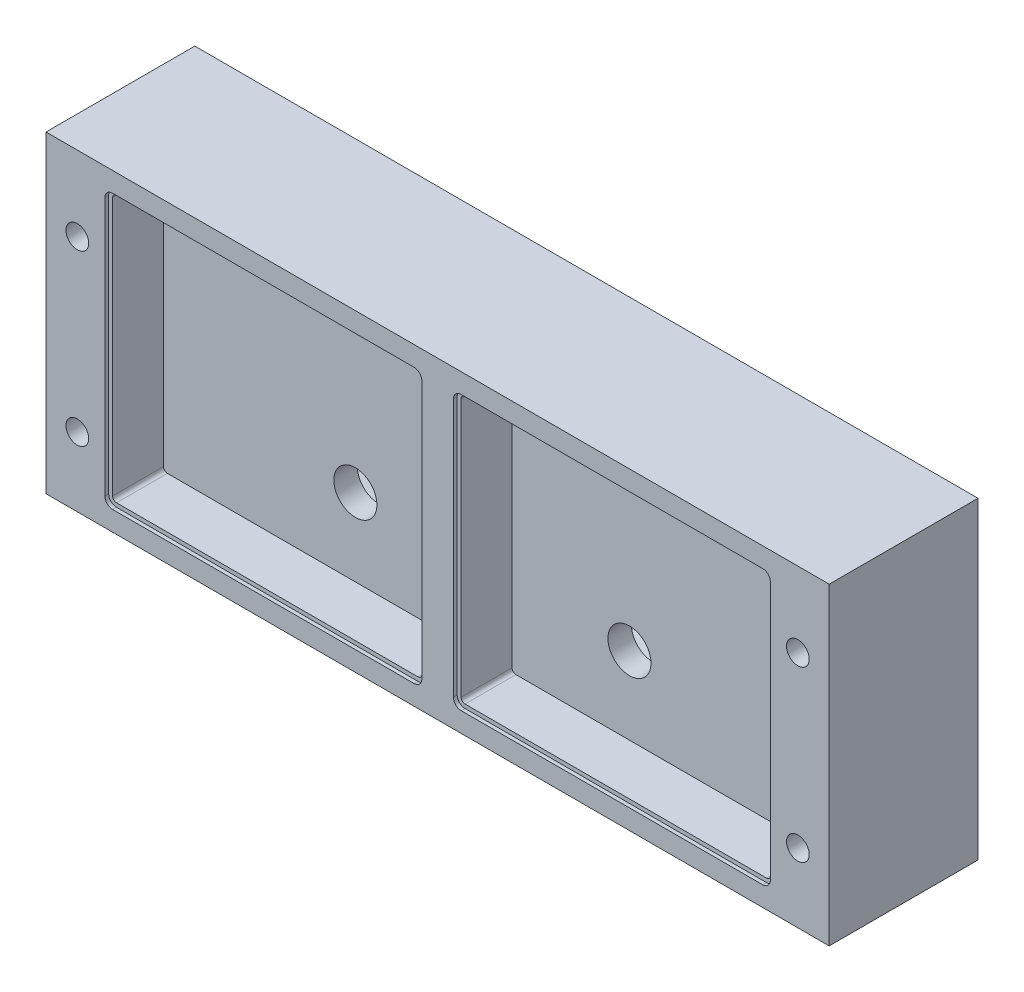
from build123d import *

# Parameters (mm, degrees)
SKETCH1_W           = 100
SKETCH1_H           = 40
BOSS_EXTRUDE1_DEPTH = 38
CUT_EXTRUDE2_START  = -12
SKETCH2_W           = 39.5
SKETCH2_H           = 34
CUT_EXTRUDE2_DEPTH  = 21
CUT_EXTRUDE4_REACH  = 81.36
SKETCH4_R           = 1.45
SKETCH6_W           = 100
SKETCH6_H           = 19
CUT_EXTRUDE5_DEPTH  = 87.215210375
FILLET1_R           = 0.5
CUT_EXTRUDE6_START  = 6.5
CUT_EXTRUDE6_DEPTH  = 0.5
CUT_EXTRUDE6_TAPER  = 2
CUT_EXTRUDE7_START  = 6.5
CUT_EXTRUDE7_DEPTH  = 0.5
CUT_EXTRUDE7_TAPER  = 2
CUT_EXTRUDE8_DEPTH  = 9
CUT_EXTRUDE9_REACH  = 72.385
SKETCH14_R          = 2.75
BOSS_EXTRUDE2_START = 8
BOSS_EXTRUDE2_DEPTH = 1
BOSS_EXTRUDE2_DRAFT = 2
CUT_EXTRUDE11_START = 9
CUT_EXTRUDE11_DEPTH = 1


with BuildPart() as part:
    # Sketch1 → Boss-Extrude1 (new body)
    with BuildSketch(Plane.XY):
        with Locations((16.25, 1.5625)):
            Rectangle(SKETCH1_W, SKETCH1_H)
    extrude(amount=BOSS_EXTRUDE1_DEPTH)

    # Sketch2 → Cut-Extrude2 (cut)
    with BuildSketch(Plane(origin=(0, 0, 0), x_dir=(-1, 0, 0), z_dir=(0, 0, -1)).offset(CUT_EXTRUDE2_START)):
        with Locations((-38.5, 1.5625)):
            Rectangle(SKETCH2_W, SKETCH2_H)
        with Locations((6, 1.5625)):
            Rectangle(SKETCH2_W, SKETCH2_H)
    extrude(amount=-CUT_EXTRUDE2_DEPTH, mode=Mode.SUBTRACT)

    # Sketch4 → Cut-Extrude4 (cut, up to next)
    with BuildSketch(Plane(origin=(0, 0, 0), x_dir=(-1, 0, 0), z_dir=(0, 0, -1)), mode=Mode.PRIVATE) as cut_extrude4_sk1:
        with Locations((-62.25, 11.98479819)):
            Circle(SKETCH4_R)
    cut_extrude4_tool1 = extrude(cut_extrude4_sk1.sketch, amount=-CUT_EXTRUDE4_REACH, mode=Mode.PRIVATE) & part.part
    # Sketch4 → Cut-Extrude4 (cut, up to next)
    with BuildSketch(Plane(origin=(0, 0, 0), x_dir=(-1, 0, 0), z_dir=(0, 0, -1)), mode=Mode.PRIVATE) as cut_extrude4_sk2:
        with Locations((-62.25, -9.616561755)):
            Circle(SKETCH4_R)
    cut_extrude4_tool2 = extrude(cut_extrude4_sk2.sketch, amount=-CUT_EXTRUDE4_REACH, mode=Mode.PRIVATE) & part.part
    # Sketch4 → Cut-Extrude4 (cut, up to next)
    with BuildSketch(Plane(origin=(0, 0, 0), x_dir=(-1, 0, 0), z_dir=(0, 0, -1)), mode=Mode.PRIVATE) as cut_extrude4_sk3:
        with Locations((29.75, 11.98479819)):
            Circle(SKETCH4_R)
    cut_extrude4_tool3 = extrude(cut_extrude4_sk3.sketch, amount=-CUT_EXTRUDE4_REACH, mode=Mode.PRIVATE) & part.part
    # Sketch4 → Cut-Extrude4 (cut, up to next)
    with BuildSketch(Plane(origin=(0, 0, 0), x_dir=(-1, 0, 0), z_dir=(0, 0, -1)), mode=Mode.PRIVATE) as cut_extrude4_sk4:
        with Locations((29.75, -9.616561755)):
            Circle(SKETCH4_R)
    cut_extrude4_tool4 = extrude(cut_extrude4_sk4.sketch, amount=-CUT_EXTRUDE4_REACH, mode=Mode.PRIVATE) & part.part
    add(cut_extrude4_tool1.solids().sort_by_distance((62.25, 11.984798, 0))[0], mode=Mode.SUBTRACT)
    add(cut_extrude4_tool2.solids().sort_by_distance((62.25, -9.616562, 0))[0], mode=Mode.SUBTRACT)
    add(cut_extrude4_tool3.solids().sort_by_distance((-29.75, 11.984798, 0))[0], mode=Mode.SUBTRACT)
    add(cut_extrude4_tool4.solids().sort_by_distance((-29.75, -9.616562, 0))[0], mode=Mode.SUBTRACT)

    # Sketch6 → Cut-Extrude5 (cut, through all)
    with BuildSketch(Plane(origin=(0, 21.5625, 0), x_dir=(1, 0, 0), z_dir=(0, 1, 0))):
        with Locations((16.25, -28.5)):
            Rectangle(SKETCH6_W, SKETCH6_H)
    extrude(amount=-CUT_EXTRUDE5_DEPTH, mode=Mode.SUBTRACT)

    # Fillet1
    fillet1_edges = [part.edges().sort_by_distance(p)[0] for p in [
        (-25.75, -15.4375, 15.5),
        (13.75, -15.4375, 15.5),
        (-25.75, 18.5625, 15.5),
        (13.75, 18.5625, 15.5),
        (18.75, -15.4375, 15.5),
        (58.25, -15.4375, 15.5),
        (18.75, 18.5625, 15.5),
        (58.25, 18.5625, 15.5),
    ]]
    fillet(fillet1_edges, radius=FILLET1_R)

    # Sketch10 → Cut-Extrude6 (cut)
    with BuildSketch(Plane.XY.offset(12).offset(CUT_EXTRUDE6_START)):
        with BuildLine():
            Line((14.25, -14.9375), (14.25, 18.0625))
            ThreePointArc((14.25, 18.0625), (13.957106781, 18.769606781), (13.25, 19.0625))
            Line((13.25, 19.0625), (-25.25, 19.0625))
            ThreePointArc((-25.25, 19.0625), (-25.957106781, 18.769606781), (-26.25, 18.0625))
            Line((-26.25, 18.0625), (-26.25, -14.9375))
            ThreePointArc((-26.25, -14.9375), (-25.957106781, -15.644606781), (-25.25, -15.9375))
            Line((-25.25, -15.9375), (13.25, -15.9375))
            ThreePointArc((13.25, -15.9375), (13.957106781, -15.644606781), (14.25, -14.9375))
        make_face()
    extrude(amount=CUT_EXTRUDE6_DEPTH, taper=CUT_EXTRUDE6_TAPER, mode=Mode.SUBTRACT)

    # Sketch11 → Cut-Extrude7 (cut)
    with BuildSketch(Plane.XY.offset(12).offset(CUT_EXTRUDE7_START)):
        with BuildLine():
            Line((58.75, -14.9375), (58.75, 18.0625))
            ThreePointArc((58.75, 18.0625), (58.457106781, 18.769606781), (57.75, 19.0625))
            Line((57.75, 19.0625), (19.25, 19.0625))
            ThreePointArc((19.25, 19.0625), (18.542893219, 18.769606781), (18.25, 18.0625))
            Line((18.25, 18.0625), (18.25, -14.9375))
            ThreePointArc((18.25, -14.9375), (18.542893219, -15.644606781), (19.25, -15.9375))
            Line((19.25, -15.9375), (57.75, -15.9375))
            ThreePointArc((57.75, -15.9375), (58.457106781, -15.644606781), (58.75, -14.9375))
        make_face()
    extrude(amount=CUT_EXTRUDE7_DEPTH, taper=CUT_EXTRUDE7_TAPER, mode=Mode.SUBTRACT)

    # Sketch12 → Cut-Extrude8 (cut)
    with BuildSketch(Plane(origin=(0, 0, 0), x_dir=(-1, 0, 0), z_dir=(0, 0, -1))):
        with BuildLine():
            ThreePointArc((-57.865926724, 2.836052), (-16.25, -14.444957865), (25.365926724, 2.836052))
            ThreePointArc((25.365926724, 2.836052), (25.351045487, 11.250609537), (16.93648795, 11.235728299))
            ThreePointArc((16.93648795, 11.235728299), (-16.25, -2.544957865), (-49.43648795, 11.235728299))
            ThreePointArc((-49.43648795, 11.235728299), (-57.851045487, 11.250609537), (-57.865926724, 2.836052))
        make_face()
    extrude(amount=-CUT_EXTRUDE8_DEPTH, mode=Mode.SUBTRACT)

    # Sketch14 → Cut-Extrude9 (cut, up to next)
    with BuildSketch(Plane(origin=(0, 0, 9), x_dir=(-1, 0, 0), z_dir=(0, 0, -1)), mode=Mode.PRIVATE) as cut_extrude9_sk1:
        with Locations((-33.75, -5.553059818)):
            Circle(SKETCH14_R)
    cut_extrude9_tool1 = extrude(cut_extrude9_sk1.sketch, amount=-CUT_EXTRUDE9_REACH, mode=Mode.PRIVATE) & part.part
    # Sketch14 → Cut-Extrude9 (cut, up to next)
    with BuildSketch(Plane(origin=(0, 0, 9), x_dir=(-1, 0, 0), z_dir=(0, 0, -1)), mode=Mode.PRIVATE) as cut_extrude9_sk2:
        with Locations((1.25, -5.553059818)):
            Circle(SKETCH14_R)
    cut_extrude9_tool2 = extrude(cut_extrude9_sk2.sketch, amount=-CUT_EXTRUDE9_REACH, mode=Mode.PRIVATE) & part.part
    add(cut_extrude9_tool1.solids().sort_by_distance((33.75, -5.55306, 9))[0], mode=Mode.SUBTRACT)
    add(cut_extrude9_tool2.solids().sort_by_distance((-1.25, -5.55306, 9))[0], mode=Mode.SUBTRACT)


with BuildPart() as body_2:
    # Sketch15 → Boss-Extrude2 (with draft: the straight prism first)
    with BuildSketch(Plane(origin=(0, 0, 9), x_dir=(-1, 0, 0), z_dir=(0, 0, -1)).offset(BOSS_EXTRUDE2_START)):
        with BuildLine():
            ThreePointArc((-49.43648795, 11.235728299), (-57.851045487, 11.250609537), (-57.865926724, 2.836052))
            ThreePointArc((-57.865926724, 2.836052), (-16.25, -14.444957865), (25.365926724, 2.836052))
            ThreePointArc((25.365926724, 2.836052), (25.351045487, 11.250609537), (16.93648795, 11.235728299))
            ThreePointArc((16.93648795, 11.235728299), (-16.25, -2.544957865), (-49.43648795, 11.235728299))
        make_face()
        with BuildLine():
            ThreePointArc((-50.144844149, 10.529873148), (-57.145190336, 10.542253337), (-57.157570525, 3.541907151))
            ThreePointArc((-57.157570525, 3.541907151), (-16.25, -13.444957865), (24.657570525, 3.541907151))
            ThreePointArc((24.657570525, 3.541907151), (24.645190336, 10.542253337), (17.644844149, 10.529873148))
            ThreePointArc((17.644844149, 10.529873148), (-16.25, -3.544957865), (-50.144844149, 10.529873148))
        make_face(mode=Mode.SUBTRACT)
    extrude(amount=BOSS_EXTRUDE2_DEPTH)
    # Boss-Extrude2: the draft: its side faces are tilted about the plane it starts from
    boss_extrude2_sides = [body_2.faces().sort_by_distance(p)[0] for p in [
        (-25.351045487, 11.250609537, 0.5),
        (16.25, -2.544957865, 0.5),
        (57.851045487, 11.250609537, 0.5),
        (16.25, -14.444957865, 0.5),
        (16.25, -13.444957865, 0.5),
        (57.145190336, 10.542253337, 0.5),
        (16.25, -3.544957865, 0.5),
        (-24.645190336, 10.542253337, 0.5),
    ]]
    draft(boss_extrude2_sides, Plane(origin=(0, 0, 9), x_dir=(-1, 0, 0), z_dir=(0, 0, -1)).offset(BOSS_EXTRUDE2_START), BOSS_EXTRUDE2_DRAFT)

    # Sketch16 → Cut-Extrude11 (cut)
    with BuildSketch(Plane(origin=(0, 0, 9), x_dir=(-1, 0, 0), z_dir=(0, 0, -1)).offset(CUT_EXTRUDE11_START)):
        with BuildLine():
            Line((-29.154329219, -0.73272854), (-29.429768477, -1.694047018))
            ThreePointArc((-29.429768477, -1.694047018), (-16.25, -3.544957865), (-3.070231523, -1.694047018))
            Line((-3.070231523, -1.694047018), (-3.345670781, -0.73272854))
            ThreePointArc((-3.345670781, -0.73272854), (-16.25, -2.544957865), (-29.154329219, -0.73272854))
        make_face()
        with BuildLine():
            Line((1.427332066, -10.672902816), (1.733433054, -11.624901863))
            ThreePointArc((1.733433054, -11.624901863), (-16.25, -14.444957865), (-34.233433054, -11.624901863))
            Line((-34.233433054, -11.624901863), (-33.927332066, -10.672902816))
            ThreePointArc((-33.927332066, -10.672902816), (-16.25, -13.444957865), (1.427332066, -10.672902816))
        make_face()
    extrude(amount=-CUT_EXTRUDE11_DEPTH, mode=Mode.SUBTRACT)


with BuildPart() as cut_extrude11_piece_1:
    # of the separate pieces the step leaves, piece 1, a body of its own (cut_extrude11_pieces)
    add(body_2.part.solids().sort_by_distance((57.865926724, 2.836052, 1))[0])


with BuildPart() as cut_extrude11_piece_2:
    # of the separate pieces the step leaves, piece 2, a body of its own (cut_extrude11_pieces)
    add(body_2.part.solids().sort_by_distance((-25.365926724, 2.836052, 1))[0])


solid = Compound([part.part, cut_extrude11_piece_1.part, cut_extrude11_piece_2.part])
